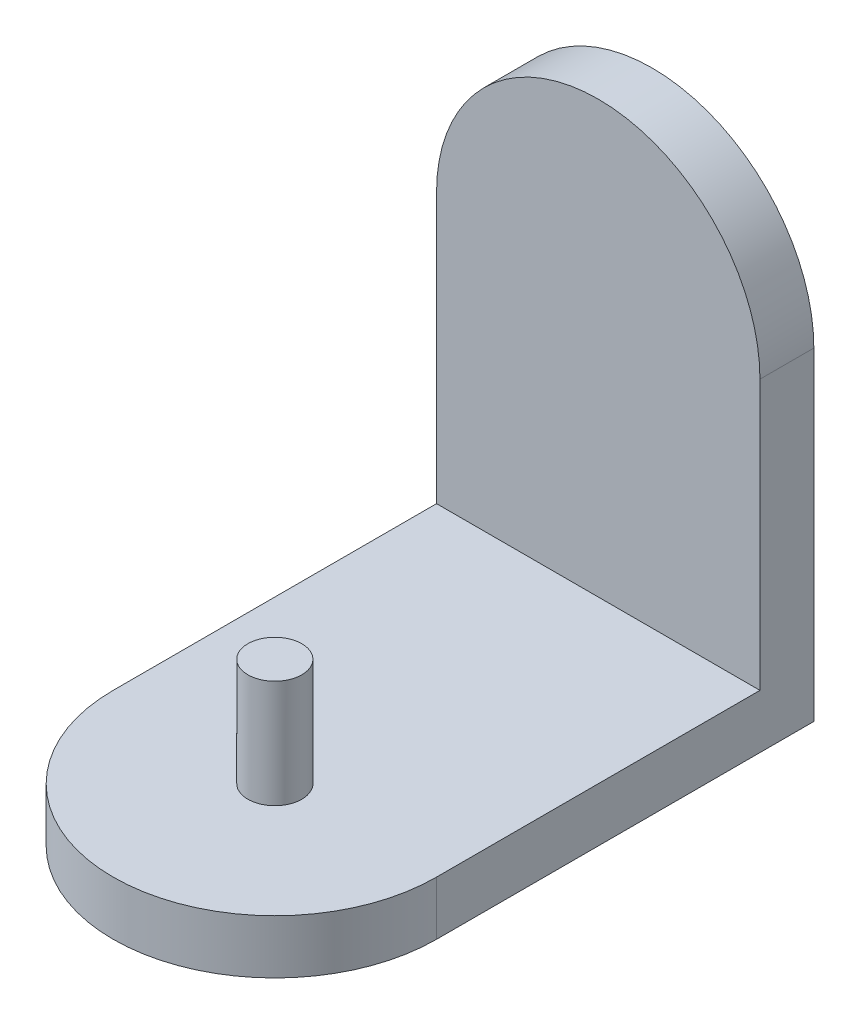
from build123d import *

# Parameters (mm, degrees)
EXTRUDE_1_DEPTH = 5
SKETCH_2_W      = 30
SKETCH_2_H      = 5
EXTRUDE_2_DEPTH = 30
EXTRUDE_3_DEPTH = 5
SKETCH_5_R      = 2.5
EXTRUDE_4_DEPTH = 10


with BuildPart() as part:
    # Sketch 1 → Extrude 1 (new body)
    with BuildSketch(Plane.XY):
        with BuildLine():
            Line((-15, 15), (-15, -15))
            Line((-15, -15), (15, -15))
            Line((15, -15), (15, 15))
            ThreePointArc((15, 15), (0, 30), (-15, 15))
        make_face()
    extrude(amount=EXTRUDE_1_DEPTH)

    # Sketch 2 → Extrude 2 (add)
    with BuildSketch(Plane.XY.offset(5)):
        with Locations((0, -12.5)):
            Rectangle(SKETCH_2_W, SKETCH_2_H)
    extrude(amount=EXTRUDE_2_DEPTH)

    # Sketch 3 → Extrude 3 (add)
    with BuildSketch(Plane(origin=(0, -10, 0), x_dir=(1, 0, 0), z_dir=(0, 1, 0))):
        with BuildLine():
            Line((15, -35), (-15, -35))
            ThreePointArc((-15, -35), (0, -50), (15, -35))
        make_face()
    extrude(amount=-EXTRUDE_3_DEPTH)

    # Sketch 5 → Extrude 4 (add)
    with BuildSketch(Plane(origin=(0, -10, 0), x_dir=(1, 0, 0), z_dir=(0, 1, 0))):
        with Locations(Location((0, -35, 0), (0, 0, 90))):
            Circle(SKETCH_5_R)
    extrude(amount=EXTRUDE_4_DEPTH)


solid = part.part
